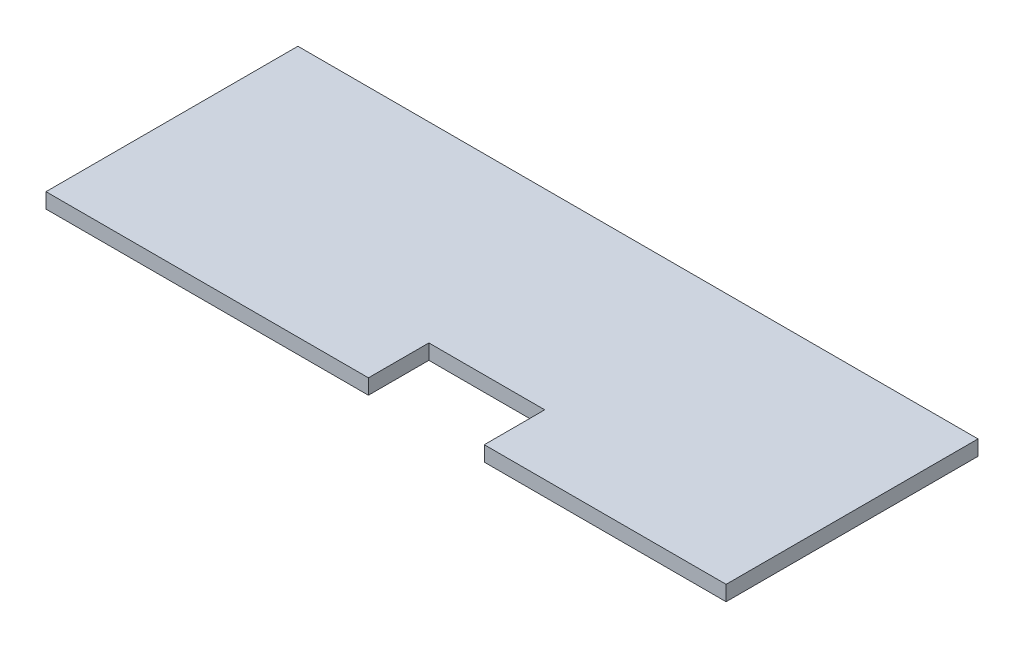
from build123d import *

# Parameters (mm, degrees)
BOSS_EXTRUDE1_DEPTH = 3


with BuildPart() as part:
    # Sketch1 → Boss-Extrude1 (new body)
    with BuildSketch(Plane(origin=(0, 0, 0), x_dir=(1, 0, 0), z_dir=(0, 1, 0))):
        Polygon((-67.5, 25), (-67.5, -25), (-3.5, -25), (-3.5, -13), (19.5, -13), (19.5, -25), (67.5, -25), (67.5, 25), align=None)
    extrude(amount=BOSS_EXTRUDE1_DEPTH)


solid = part.part
